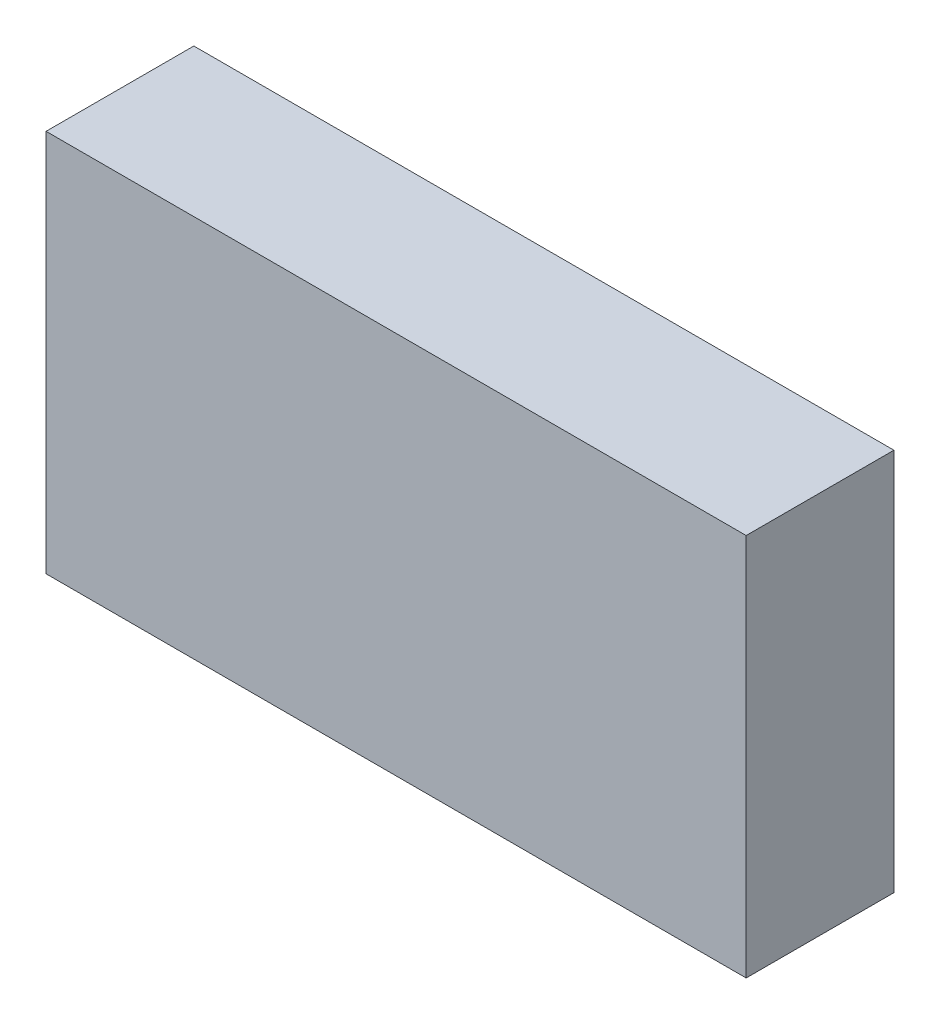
from build123d import *

# Parameters (mm, degrees)
SKETCH1_W      = 170.024730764
SKETCH1_H      = 93.066714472
EXTRUDE1_DEPTH = 35.886761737


with BuildPart() as part:
    # Sketch1 → Extrude1 (new body)
    with BuildSketch(Plane.XY):
        Rectangle(SKETCH1_W, SKETCH1_H)
    extrude(amount=EXTRUDE1_DEPTH)


solid = part.part
